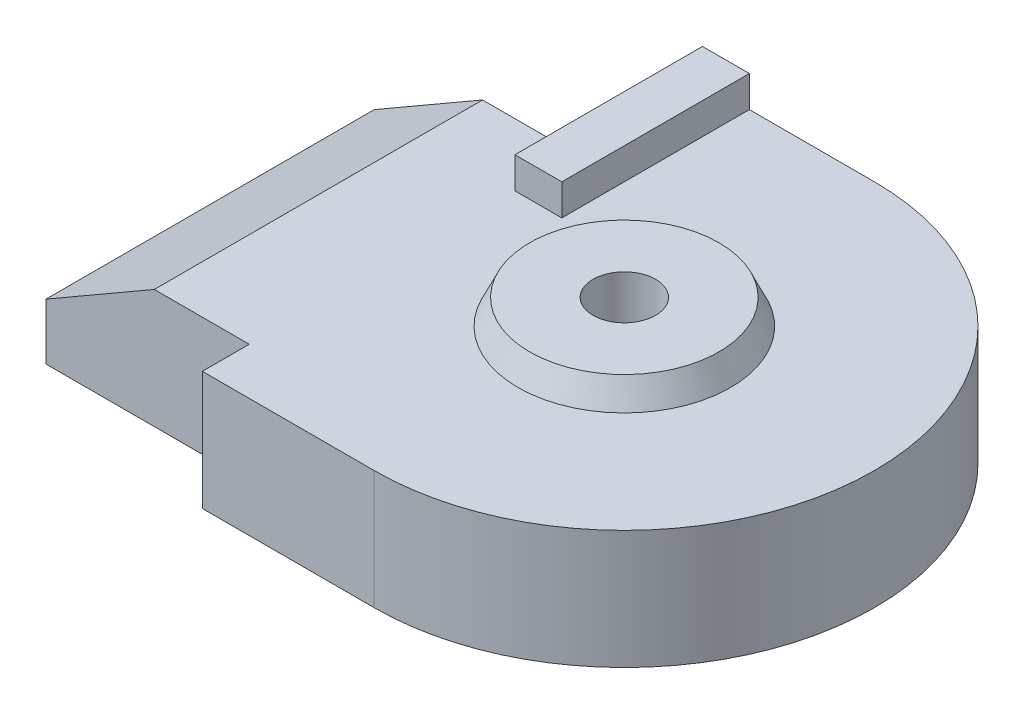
ISO-10303-21;
HEADER;
FILE_DESCRIPTION(('STEP AP214'),'2;1');
FILE_NAME('part.step','',(''),(''),'','','');
FILE_SCHEMA(('AUTOMOTIVE_DESIGN { 1 0 10303 214 1 1 1 1 }'));
ENDSEC;
DATA;
#1=APPLICATION_CONTEXT('core data for automotive mechanical design processes');
#2=APPLICATION_PROTOCOL_DEFINITION('international standard','automotive_design',2000,#1);
#3=PRODUCT_CONTEXT('',#1,'mechanical');
#4=PRODUCT('Part','Part','',(#3));
#5=PRODUCT_RELATED_PRODUCT_CATEGORY('part','',(#4));
#6=PRODUCT_DEFINITION_FORMATION('','',#4);
#7=PRODUCT_DEFINITION_CONTEXT('part definition',#1,'design');
#8=PRODUCT_DEFINITION('design','',#6,#7);
#9=PRODUCT_DEFINITION_SHAPE('','',#8);
#10=(LENGTH_UNIT() NAMED_UNIT(*) SI_UNIT(.MILLI.,.METRE.));
#11=(NAMED_UNIT(*) PLANE_ANGLE_UNIT() SI_UNIT($,.RADIAN.));
#12=(NAMED_UNIT(*) SI_UNIT($,.STERADIAN.) SOLID_ANGLE_UNIT());
#13=UNCERTAINTY_MEASURE_WITH_UNIT(LENGTH_MEASURE(1.E-05),#10,'distance_accuracy_value','');
#14=(GEOMETRIC_REPRESENTATION_CONTEXT(3) GLOBAL_UNCERTAINTY_ASSIGNED_CONTEXT((#13)) GLOBAL_UNIT_ASSIGNED_CONTEXT((#10,
#11,#12)) REPRESENTATION_CONTEXT('',''));
#15=CARTESIAN_POINT('',(0.,0.,0.));
#16=DIRECTION('',(0.,0.,1.));
#17=DIRECTION('',(1.,0.,0.));
#18=AXIS2_PLACEMENT_3D('',#15,#16,#17);
#19=CARTESIAN_POINT('',(0.,190.,0.));
#20=DIRECTION('',(0.,1.,0.));
#21=DIRECTION('',(0.,0.,1.));
#22=AXIS2_PLACEMENT_3D('',#19,#20,#21);
#23=PLANE('',#22);
#24=CARTESIAN_POINT('',(0.,190.,0.));
#25=DIRECTION('',(0.,1.,0.));
#26=DIRECTION('',(0.,0.,1.));
#27=AXIS2_PLACEMENT_3D('',#24,#25,#26);
#28=CIRCLE('',#27,170.);
#29=CARTESIAN_POINT('',(0.,190.,170.));
#30=VERTEX_POINT('',#29);
#31=EDGE_CURVE('E127',#30,#30,#28,.T.);
#32=ORIENTED_EDGE('',*,*,#31,.F.);
#33=EDGE_LOOP('',(#32));
#34=FACE_BOUND('',#33,.T.);
#35=DIRECTION('',(1.,0.,0.));
#36=VECTOR('',#35,1.);
#37=CARTESIAN_POINT('',(-275.,190.,-100.));
#38=LINE('',#37,#36);
#39=CARTESIAN_POINT('',(-275.,190.,-100.));
#40=VERTEX_POINT('',#39);
#41=CARTESIAN_POINT('',(-200.,190.,-100.));
#42=VERTEX_POINT('',#41);
#43=EDGE_CURVE('E32',#40,#42,#38,.T.);
#44=ORIENTED_EDGE('',*,*,#43,.F.);
#45=DIRECTION('',(0.,0.,1.));
#46=VECTOR('',#45,1.);
#47=CARTESIAN_POINT('',(-275.,190.,-400.));
#48=LINE('',#47,#46);
#49=CARTESIAN_POINT('',(-275.,190.,-200.));
#50=VERTEX_POINT('',#49);
#51=EDGE_CURVE('E126',#50,#40,#48,.T.);
#52=ORIENTED_EDGE('',*,*,#51,.F.);
#53=DIRECTION('',(-1.,0.,0.));
#54=VECTOR('',#53,1.);
#55=CARTESIAN_POINT('',(-275.,190.,-200.));
#56=LINE('',#55,#54);
#57=CARTESIAN_POINT('',(-426.794919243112,190.,-200.));
#58=VERTEX_POINT('',#57);
#59=EDGE_CURVE('E147',#50,#58,#56,.T.);
#60=ORIENTED_EDGE('',*,*,#59,.T.);
#61=DIRECTION('',(0.,0.,1.));
#62=VECTOR('',#61,1.);
#63=CARTESIAN_POINT('',(-426.794919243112,190.,325.));
#64=LINE('',#63,#62);
#65=CARTESIAN_POINT('',(-426.794919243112,190.,325.));
#66=VERTEX_POINT('',#65);
#67=EDGE_CURVE('E192',#58,#66,#64,.T.);
#68=ORIENTED_EDGE('',*,*,#67,.T.);
#69=DIRECTION('',(1.,0.,0.));
#70=VECTOR('',#69,1.);
#71=CARTESIAN_POINT('',(-600.,190.,325.));
#72=LINE('',#71,#70);
#73=CARTESIAN_POINT('',(-275.,190.,325.));
#74=VERTEX_POINT('',#73);
#75=EDGE_CURVE('E150',#66,#74,#72,.T.);
#76=ORIENTED_EDGE('',*,*,#75,.T.);
#77=DIRECTION('',(0.,0.,1.));
#78=VECTOR('',#77,1.);
#79=CARTESIAN_POINT('',(-275.,190.,325.));
#80=LINE('',#79,#78);
#81=CARTESIAN_POINT('',(-275.,190.,400.));
#82=VERTEX_POINT('',#81);
#83=EDGE_CURVE('E152',#74,#82,#80,.T.);
#84=ORIENTED_EDGE('',*,*,#83,.T.);
#85=DIRECTION('',(1.,0.,0.));
#86=VECTOR('',#85,1.);
#87=CARTESIAN_POINT('',(-275.,190.,400.));
#88=LINE('',#87,#86);
#89=CARTESIAN_POINT('',(0.,190.,400.));
#90=VERTEX_POINT('',#89);
#91=EDGE_CURVE('E139',#82,#90,#88,.T.);
#92=ORIENTED_EDGE('',*,*,#91,.T.);
#93=CARTESIAN_POINT('',(0.,190.,0.));
#94=DIRECTION('',(0.,1.,0.));
#95=DIRECTION('',(0.,0.,1.));
#96=AXIS2_PLACEMENT_3D('',#93,#94,#95);
#97=CIRCLE('',#96,400.);
#98=CARTESIAN_POINT('',(0.,190.,-400.));
#99=VERTEX_POINT('',#98);
#100=EDGE_CURVE('E142',#90,#99,#97,.T.);
#101=ORIENTED_EDGE('',*,*,#100,.T.);
#102=DIRECTION('',(-1.,0.,0.));
#103=VECTOR('',#102,1.);
#104=CARTESIAN_POINT('',(0.,190.,-400.));
#105=LINE('',#104,#103);
#106=CARTESIAN_POINT('',(-200.,190.,-400.));
#107=VERTEX_POINT('',#106);
#108=EDGE_CURVE('E145',#99,#107,#105,.T.);
#109=ORIENTED_EDGE('',*,*,#108,.T.);
#110=DIRECTION('',(0.,0.,-1.));
#111=VECTOR('',#110,1.);
#112=CARTESIAN_POINT('',(-200.,190.,-400.));
#113=LINE('',#112,#111);
#114=EDGE_CURVE('E37',#42,#107,#113,.T.);
#115=ORIENTED_EDGE('',*,*,#114,.F.);
#116=EDGE_LOOP('',(#44,#52,#60,#68,#76,#84,#92,#101,#109,#115));
#117=FACE_BOUND('',#116,.T.);
#118=ADVANCED_FACE('F17',(#34,#117),#23,.T.);
#119=CARTESIAN_POINT('',(-275.,190.,400.));
#120=DIRECTION('',(0.,0.,-1.));
#121=DIRECTION('',(-1.,0.,0.));
#122=AXIS2_PLACEMENT_3D('',#119,#120,#121);
#123=PLANE('',#122);
#124=DIRECTION('',(1.,0.,0.));
#125=VECTOR('',#124,1.);
#126=CARTESIAN_POINT('',(-275.,0.,400.));
#127=LINE('',#126,#125);
#128=CARTESIAN_POINT('',(-275.,0.,400.));
#129=VERTEX_POINT('',#128);
#130=CARTESIAN_POINT('',(0.,0.,400.));
#131=VERTEX_POINT('',#130);
#132=EDGE_CURVE('E138',#129,#131,#127,.T.);
#133=ORIENTED_EDGE('',*,*,#132,.T.);
#134=DIRECTION('',(0.,-1.,0.));
#135=VECTOR('',#134,1.);
#136=CARTESIAN_POINT('',(0.,190.,400.));
#137=LINE('',#136,#135);
#138=EDGE_CURVE('E189',#90,#131,#137,.T.);
#139=ORIENTED_EDGE('',*,*,#138,.F.);
#140=ORIENTED_EDGE('',*,*,#91,.F.);
#141=DIRECTION('',(0.,-1.,0.));
#142=VECTOR('',#141,1.);
#143=CARTESIAN_POINT('',(-275.,190.,400.));
#144=LINE('',#143,#142);
#145=EDGE_CURVE('E154',#82,#129,#144,.T.);
#146=ORIENTED_EDGE('',*,*,#145,.T.);
#147=EDGE_LOOP('',(#133,#139,#140,#146));
#148=FACE_BOUND('',#147,.T.);
#149=ADVANCED_FACE('F222',(#148),#123,.F.);
#150=CARTESIAN_POINT('',(0.,190.,0.));
#151=DIRECTION('',(0.,-1.,0.));
#152=DIRECTION('',(0.,0.,-1.));
#153=AXIS2_PLACEMENT_3D('',#150,#151,#152);
#154=CYLINDRICAL_SURFACE('',#153,400.);
#155=CARTESIAN_POINT('',(0.,0.,0.));
#156=DIRECTION('',(0.,1.,0.));
#157=DIRECTION('',(0.,0.,1.));
#158=AXIS2_PLACEMENT_3D('',#155,#156,#157);
#159=CIRCLE('',#158,400.);
#160=CARTESIAN_POINT('',(0.,0.,-400.));
#161=VERTEX_POINT('',#160);
#162=EDGE_CURVE('E157',#131,#161,#159,.T.);
#163=ORIENTED_EDGE('',*,*,#162,.T.);
#164=DIRECTION('',(0.,-1.,0.));
#165=VECTOR('',#164,1.);
#166=CARTESIAN_POINT('',(0.,190.,-400.));
#167=LINE('',#166,#165);
#168=EDGE_CURVE('E186',#99,#161,#167,.T.);
#169=ORIENTED_EDGE('',*,*,#168,.F.);
#170=ORIENTED_EDGE('',*,*,#100,.F.);
#171=ORIENTED_EDGE('',*,*,#138,.T.);
#172=EDGE_LOOP('',(#163,#169,#170,#171));
#173=FACE_BOUND('',#172,.T.);
#174=ADVANCED_FACE('F225',(#173),#154,.T.);
#175=CARTESIAN_POINT('',(0.,190.,-400.));
#176=DIRECTION('',(0.,0.,1.));
#177=DIRECTION('',(1.,0.,0.));
#178=AXIS2_PLACEMENT_3D('',#175,#176,#177);
#179=PLANE('',#178);
#180=DIRECTION('',(-1.,0.,0.));
#181=VECTOR('',#180,1.);
#182=CARTESIAN_POINT('',(0.,0.,-400.));
#183=LINE('',#182,#181);
#184=CARTESIAN_POINT('',(-275.,0.,-400.));
#185=VERTEX_POINT('',#184);
#186=EDGE_CURVE('E159',#161,#185,#183,.T.);
#187=ORIENTED_EDGE('',*,*,#186,.T.);
#188=DIRECTION('',(0.,-1.,0.));
#189=VECTOR('',#188,1.);
#190=CARTESIAN_POINT('',(-275.,190.,-400.));
#191=LINE('',#190,#189);
#192=CARTESIAN_POINT('',(-275.,240.,-400.));
#193=VERTEX_POINT('',#192);
#194=EDGE_CURVE('E184',#193,#185,#191,.T.);
#195=ORIENTED_EDGE('',*,*,#194,.F.);
#196=DIRECTION('',(-1.,0.,0.));
#197=VECTOR('',#196,1.);
#198=CARTESIAN_POINT('',(-275.,240.,-400.));
#199=LINE('',#198,#197);
#200=CARTESIAN_POINT('',(-200.,240.,-400.));
#201=VERTEX_POINT('',#200);
#202=EDGE_CURVE('E120',#201,#193,#199,.T.);
#203=ORIENTED_EDGE('',*,*,#202,.F.);
#204=DIRECTION('',(0.,-1.,0.));
#205=VECTOR('',#204,1.);
#206=CARTESIAN_POINT('',(-200.,240.,-400.));
#207=LINE('',#206,#205);
#208=EDGE_CURVE('E132',#201,#107,#207,.T.);
#209=ORIENTED_EDGE('',*,*,#208,.T.);
#210=ORIENTED_EDGE('',*,*,#108,.F.);
#211=ORIENTED_EDGE('',*,*,#168,.T.);
#212=EDGE_LOOP('',(#187,#195,#203,#209,#210,#211));
#213=FACE_BOUND('',#212,.T.);
#214=ADVANCED_FACE('F230',(#213),#179,.F.);
#215=CARTESIAN_POINT('',(-275.,190.,-400.));
#216=DIRECTION('',(1.,0.,0.));
#217=DIRECTION('',(0.,0.,-1.));
#218=AXIS2_PLACEMENT_3D('',#215,#216,#217);
#219=PLANE('',#218);
#220=DIRECTION('',(0.,0.,1.));
#221=VECTOR('',#220,1.);
#222=CARTESIAN_POINT('',(-275.,0.,-400.));
#223=LINE('',#222,#221);
#224=CARTESIAN_POINT('',(-275.,0.,-200.));
#225=VERTEX_POINT('',#224);
#226=EDGE_CURVE('E161',#185,#225,#223,.T.);
#227=ORIENTED_EDGE('',*,*,#226,.T.);
#228=DIRECTION('',(0.,-1.,0.));
#229=VECTOR('',#228,1.);
#230=CARTESIAN_POINT('',(-275.,190.,-200.));
#231=LINE('',#230,#229);
#232=EDGE_CURVE('E181',#50,#225,#231,.T.);
#233=ORIENTED_EDGE('',*,*,#232,.F.);
#234=ORIENTED_EDGE('',*,*,#51,.T.);
#235=DIRECTION('',(0.,-1.,0.));
#236=VECTOR('',#235,1.);
#237=CARTESIAN_POINT('',(-275.,240.,-100.));
#238=LINE('',#237,#236);
#239=CARTESIAN_POINT('',(-275.,240.,-100.));
#240=VERTEX_POINT('',#239);
#241=EDGE_CURVE('E108',#240,#40,#238,.T.);
#242=ORIENTED_EDGE('',*,*,#241,.F.);
#243=DIRECTION('',(0.,0.,1.));
#244=VECTOR('',#243,1.);
#245=CARTESIAN_POINT('',(-275.,240.,-400.));
#246=LINE('',#245,#244);
#247=EDGE_CURVE('E114',#193,#240,#246,.T.);
#248=ORIENTED_EDGE('',*,*,#247,.F.);
#249=ORIENTED_EDGE('',*,*,#194,.T.);
#250=EDGE_LOOP('',(#227,#233,#234,#242,#248,#249));
#251=FACE_BOUND('',#250,.T.);
#252=ADVANCED_FACE('F124',(#251),#219,.F.);
#253=CARTESIAN_POINT('',(-275.,190.,-200.));
#254=DIRECTION('',(0.,0.,1.));
#255=DIRECTION('',(1.,0.,0.));
#256=AXIS2_PLACEMENT_3D('',#253,#254,#255);
#257=PLANE('',#256);
#258=DIRECTION('',(0.,-1.,0.));
#259=VECTOR('',#258,1.);
#260=CARTESIAN_POINT('',(-600.,190.,-200.));
#261=LINE('',#260,#259);
#262=CARTESIAN_POINT('',(-600.,90.,-200.));
#263=VERTEX_POINT('',#262);
#264=CARTESIAN_POINT('',(-600.,0.,-200.));
#265=VERTEX_POINT('',#264);
#266=EDGE_CURVE('E179',#263,#265,#261,.T.);
#267=ORIENTED_EDGE('',*,*,#266,.F.);
#268=DIRECTION('',(0.866025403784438,0.5,0.));
#269=VECTOR('',#268,1.);
#270=CARTESIAN_POINT('',(-426.794919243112,190.,-200.));
#271=LINE('',#270,#269);
#272=EDGE_CURVE('E11',#263,#58,#271,.T.);
#273=ORIENTED_EDGE('',*,*,#272,.T.);
#274=ORIENTED_EDGE('',*,*,#59,.F.);
#275=ORIENTED_EDGE('',*,*,#232,.T.);
#276=DIRECTION('',(-1.,0.,0.));
#277=VECTOR('',#276,1.);
#278=CARTESIAN_POINT('',(-275.,0.,-200.));
#279=LINE('',#278,#277);
#280=EDGE_CURVE('E163',#225,#265,#279,.T.);
#281=ORIENTED_EDGE('',*,*,#280,.T.);
#282=EDGE_LOOP('',(#267,#273,#274,#275,#281));
#283=FACE_BOUND('',#282,.T.);
#284=ADVANCED_FACE('F204',(#283),#257,.F.);
#285=CARTESIAN_POINT('',(-600.,190.,-200.));
#286=DIRECTION('',(1.,0.,0.));
#287=DIRECTION('',(0.,0.,-1.));
#288=AXIS2_PLACEMENT_3D('',#285,#286,#287);
#289=PLANE('',#288);
#290=DIRECTION('',(0.,-1.,0.));
#291=VECTOR('',#290,1.);
#292=CARTESIAN_POINT('',(-600.,190.,325.));
#293=LINE('',#292,#291);
#294=CARTESIAN_POINT('',(-600.,90.,325.));
#295=VERTEX_POINT('',#294);
#296=CARTESIAN_POINT('',(-600.,0.,325.));
#297=VERTEX_POINT('',#296);
#298=EDGE_CURVE('E177',#295,#297,#293,.T.);
#299=ORIENTED_EDGE('',*,*,#298,.F.);
#300=DIRECTION('',(0.,0.,-1.));
#301=VECTOR('',#300,1.);
#302=CARTESIAN_POINT('',(-600.,90.,-200.));
#303=LINE('',#302,#301);
#304=EDGE_CURVE('E25',#295,#263,#303,.T.);
#305=ORIENTED_EDGE('',*,*,#304,.T.);
#306=ORIENTED_EDGE('',*,*,#266,.T.);
#307=DIRECTION('',(0.,0.,1.));
#308=VECTOR('',#307,1.);
#309=CARTESIAN_POINT('',(-600.,0.,-200.));
#310=LINE('',#309,#308);
#311=EDGE_CURVE('E166',#265,#297,#310,.T.);
#312=ORIENTED_EDGE('',*,*,#311,.T.);
#313=EDGE_LOOP('',(#299,#305,#306,#312));
#314=FACE_BOUND('',#313,.T.);
#315=ADVANCED_FACE('F200',(#314),#289,.F.);
#316=CARTESIAN_POINT('',(-600.,190.,325.));
#317=DIRECTION('',(0.,0.,-1.));
#318=DIRECTION('',(-1.,0.,0.));
#319=AXIS2_PLACEMENT_3D('',#316,#317,#318);
#320=PLANE('',#319);
#321=ORIENTED_EDGE('',*,*,#75,.F.);
#322=DIRECTION('',(-0.866025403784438,-0.5,0.));
#323=VECTOR('',#322,1.);
#324=CARTESIAN_POINT('',(-426.794919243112,190.,325.));
#325=LINE('',#324,#323);
#326=EDGE_CURVE('E195',#66,#295,#325,.T.);
#327=ORIENTED_EDGE('',*,*,#326,.T.);
#328=ORIENTED_EDGE('',*,*,#298,.T.);
#329=DIRECTION('',(1.,0.,0.));
#330=VECTOR('',#329,1.);
#331=CARTESIAN_POINT('',(-600.,0.,325.));
#332=LINE('',#331,#330);
#333=CARTESIAN_POINT('',(-275.,0.,325.));
#334=VERTEX_POINT('',#333);
#335=EDGE_CURVE('E169',#297,#334,#332,.T.);
#336=ORIENTED_EDGE('',*,*,#335,.T.);
#337=DIRECTION('',(0.,-1.,0.));
#338=VECTOR('',#337,1.);
#339=CARTESIAN_POINT('',(-275.,190.,325.));
#340=LINE('',#339,#338);
#341=EDGE_CURVE('E174',#74,#334,#340,.T.);
#342=ORIENTED_EDGE('',*,*,#341,.F.);
#343=EDGE_LOOP('',(#321,#327,#328,#336,#342));
#344=FACE_BOUND('',#343,.T.);
#345=ADVANCED_FACE('F211',(#344),#320,.F.);
#346=CARTESIAN_POINT('',(-275.,190.,325.));
#347=DIRECTION('',(1.,0.,0.));
#348=DIRECTION('',(0.,0.,-1.));
#349=AXIS2_PLACEMENT_3D('',#346,#347,#348);
#350=PLANE('',#349);
#351=DIRECTION('',(0.,0.,1.));
#352=VECTOR('',#351,1.);
#353=CARTESIAN_POINT('',(-275.,0.,325.));
#354=LINE('',#353,#352);
#355=EDGE_CURVE('E143',#334,#129,#354,.T.);
#356=ORIENTED_EDGE('',*,*,#355,.T.);
#357=ORIENTED_EDGE('',*,*,#145,.F.);
#358=ORIENTED_EDGE('',*,*,#83,.F.);
#359=ORIENTED_EDGE('',*,*,#341,.T.);
#360=EDGE_LOOP('',(#356,#357,#358,#359));
#361=FACE_BOUND('',#360,.T.);
#362=ADVANCED_FACE('F217',(#361),#350,.F.);
#363=CARTESIAN_POINT('',(0.,0.,0.));
#364=DIRECTION('',(0.,1.,0.));
#365=DIRECTION('',(0.,0.,1.));
#366=AXIS2_PLACEMENT_3D('',#363,#364,#365);
#367=PLANE('',#366);
#368=CARTESIAN_POINT('',(0.,0.,0.));
#369=DIRECTION('',(0.,1.,0.));
#370=DIRECTION('',(0.,0.,1.));
#371=AXIS2_PLACEMENT_3D('',#368,#369,#370);
#372=CIRCLE('',#371,50.);
#373=CARTESIAN_POINT('',(0.,0.,50.));
#374=VERTEX_POINT('',#373);
#375=EDGE_CURVE('E239',#374,#374,#372,.T.);
#376=ORIENTED_EDGE('',*,*,#375,.T.);
#377=EDGE_LOOP('',(#376));
#378=FACE_BOUND('',#377,.T.);
#379=ORIENTED_EDGE('',*,*,#132,.F.);
#380=ORIENTED_EDGE('',*,*,#355,.F.);
#381=ORIENTED_EDGE('',*,*,#335,.F.);
#382=ORIENTED_EDGE('',*,*,#311,.F.);
#383=ORIENTED_EDGE('',*,*,#280,.F.);
#384=ORIENTED_EDGE('',*,*,#226,.F.);
#385=ORIENTED_EDGE('',*,*,#186,.F.);
#386=ORIENTED_EDGE('',*,*,#162,.F.);
#387=EDGE_LOOP('',(#379,#380,#381,#382,#383,#384,#385,#386));
#388=FACE_BOUND('',#387,.T.);
#389=ADVANCED_FACE('F271',(#378,#388),#367,.F.);
#390=CARTESIAN_POINT('',(-426.794919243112,190.,0.));
#391=DIRECTION('',(-0.5,0.866025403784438,0.));
#392=DIRECTION('',(-0.866025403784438,-0.5,0.));
#393=AXIS2_PLACEMENT_3D('',#390,#391,#392);
#394=PLANE('',#393);
#395=ORIENTED_EDGE('',*,*,#272,.F.);
#396=ORIENTED_EDGE('',*,*,#304,.F.);
#397=ORIENTED_EDGE('',*,*,#326,.F.);
#398=ORIENTED_EDGE('',*,*,#67,.F.);
#399=EDGE_LOOP('',(#395,#396,#397,#398));
#400=FACE_BOUND('',#399,.T.);
#401=ADVANCED_FACE('F19',(#400),#394,.T.);
#402=CARTESIAN_POINT('',(0.,190.,0.));
#403=DIRECTION('',(0.,-1.,0.));
#404=DIRECTION('',(0.,0.,1.));
#405=AXIS2_PLACEMENT_3D('',#402,#403,#404);
#406=CONICAL_SURFACE('',#405,170.,0.436332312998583);
#407=CARTESIAN_POINT('',(0.,230.,0.));
#408=DIRECTION('',(0.,1.,0.));
#409=DIRECTION('',(0.,0.,1.));
#410=AXIS2_PLACEMENT_3D('',#407,#408,#409);
#411=CIRCLE('',#410,151.3476936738);
#412=CARTESIAN_POINT('',(0.,230.,151.3476936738));
#413=VERTEX_POINT('',#412);
#414=EDGE_CURVE('E130',#413,#413,#411,.T.);
#415=ORIENTED_EDGE('',*,*,#414,.F.);
#416=EDGE_LOOP('',(#415));
#417=FACE_BOUND('',#416,.T.);
#418=ORIENTED_EDGE('',*,*,#31,.T.);
#419=EDGE_LOOP('',(#418));
#420=FACE_BOUND('',#419,.T.);
#421=ADVANCED_FACE('F254',(#417,#420),#406,.T.);
#422=CARTESIAN_POINT('',(0.,230.,0.));
#423=DIRECTION('',(0.,1.,0.));
#424=DIRECTION('',(0.,0.,1.));
#425=AXIS2_PLACEMENT_3D('',#422,#423,#424);
#426=PLANE('',#425);
#427=CARTESIAN_POINT('',(0.,230.,0.));
#428=DIRECTION('',(0.,1.,0.));
#429=DIRECTION('',(0.,0.,1.));
#430=AXIS2_PLACEMENT_3D('',#427,#428,#429);
#431=CIRCLE('',#430,50.);
#432=CARTESIAN_POINT('',(0.,230.,50.));
#433=VERTEX_POINT('',#432);
#434=EDGE_CURVE('E241',#433,#433,#431,.T.);
#435=ORIENTED_EDGE('',*,*,#434,.F.);
#436=EDGE_LOOP('',(#435));
#437=FACE_BOUND('',#436,.T.);
#438=ORIENTED_EDGE('',*,*,#414,.T.);
#439=EDGE_LOOP('',(#438));
#440=FACE_BOUND('',#439,.T.);
#441=ADVANCED_FACE('F251',(#437,#440),#426,.T.);
#442=CARTESIAN_POINT('',(-275.,240.,-100.));
#443=DIRECTION('',(0.,0.,-1.));
#444=DIRECTION('',(-1.,0.,0.));
#445=AXIS2_PLACEMENT_3D('',#442,#443,#444);
#446=PLANE('',#445);
#447=ORIENTED_EDGE('',*,*,#43,.T.);
#448=DIRECTION('',(0.,-1.,0.));
#449=VECTOR('',#448,1.);
#450=CARTESIAN_POINT('',(-200.,240.,-100.));
#451=LINE('',#450,#449);
#452=CARTESIAN_POINT('',(-200.,240.,-100.));
#453=VERTEX_POINT('',#452);
#454=EDGE_CURVE('E110',#453,#42,#451,.T.);
#455=ORIENTED_EDGE('',*,*,#454,.F.);
#456=DIRECTION('',(1.,0.,0.));
#457=VECTOR('',#456,1.);
#458=CARTESIAN_POINT('',(-275.,240.,-100.));
#459=LINE('',#458,#457);
#460=EDGE_CURVE('E104',#240,#453,#459,.T.);
#461=ORIENTED_EDGE('',*,*,#460,.F.);
#462=ORIENTED_EDGE('',*,*,#241,.T.);
#463=EDGE_LOOP('',(#447,#455,#461,#462));
#464=FACE_BOUND('',#463,.T.);
#465=ADVANCED_FACE('F106',(#464),#446,.F.);
#466=CARTESIAN_POINT('',(-200.,240.,-400.));
#467=DIRECTION('',(-1.,0.,0.));
#468=DIRECTION('',(0.,0.,1.));
#469=AXIS2_PLACEMENT_3D('',#466,#467,#468);
#470=PLANE('',#469);
#471=ORIENTED_EDGE('',*,*,#114,.T.);
#472=ORIENTED_EDGE('',*,*,#208,.F.);
#473=DIRECTION('',(0.,0.,-1.));
#474=VECTOR('',#473,1.);
#475=CARTESIAN_POINT('',(-200.,240.,-400.));
#476=LINE('',#475,#474);
#477=EDGE_CURVE('E113',#453,#201,#476,.T.);
#478=ORIENTED_EDGE('',*,*,#477,.F.);
#479=ORIENTED_EDGE('',*,*,#454,.T.);
#480=EDGE_LOOP('',(#471,#472,#478,#479));
#481=FACE_BOUND('',#480,.T.);
#482=ADVANCED_FACE('F233',(#481),#470,.F.);
#483=CARTESIAN_POINT('',(-275.,240.,-100.));
#484=DIRECTION('',(0.,1.,0.));
#485=DIRECTION('',(0.,0.,1.));
#486=AXIS2_PLACEMENT_3D('',#483,#484,#485);
#487=PLANE('',#486);
#488=ORIENTED_EDGE('',*,*,#247,.T.);
#489=ORIENTED_EDGE('',*,*,#460,.T.);
#490=ORIENTED_EDGE('',*,*,#477,.T.);
#491=ORIENTED_EDGE('',*,*,#202,.T.);
#492=EDGE_LOOP('',(#488,#489,#490,#491));
#493=FACE_BOUND('',#492,.T.);
#494=ADVANCED_FACE('F118',(#493),#487,.T.);
#495=CARTESIAN_POINT('',(0.,0.,0.));
#496=DIRECTION('',(0.,1.,0.));
#497=DIRECTION('',(0.,0.,1.));
#498=AXIS2_PLACEMENT_3D('',#495,#496,#497);
#499=CYLINDRICAL_SURFACE('',#498,50.);
#500=ORIENTED_EDGE('',*,*,#375,.F.);
#501=EDGE_LOOP('',(#500));
#502=FACE_BOUND('',#501,.T.);
#503=ORIENTED_EDGE('',*,*,#434,.T.);
#504=EDGE_LOOP('',(#503));
#505=FACE_BOUND('',#504,.T.);
#506=ADVANCED_FACE('F249',(#502,#505),#499,.F.);
#507=CLOSED_SHELL('',(#118,#149,#174,#214,#252,#284,#315,#345,#362,#389,#401,#421,#441,#465,
#482,#494,#506));
#508=MANIFOLD_SOLID_BREP('B1',#507);
#509=ADVANCED_BREP_SHAPE_REPRESENTATION('',(#18,#508),#14);
#510=SHAPE_DEFINITION_REPRESENTATION(#9,#509);
ENDSEC;
END-ISO-10303-21;
